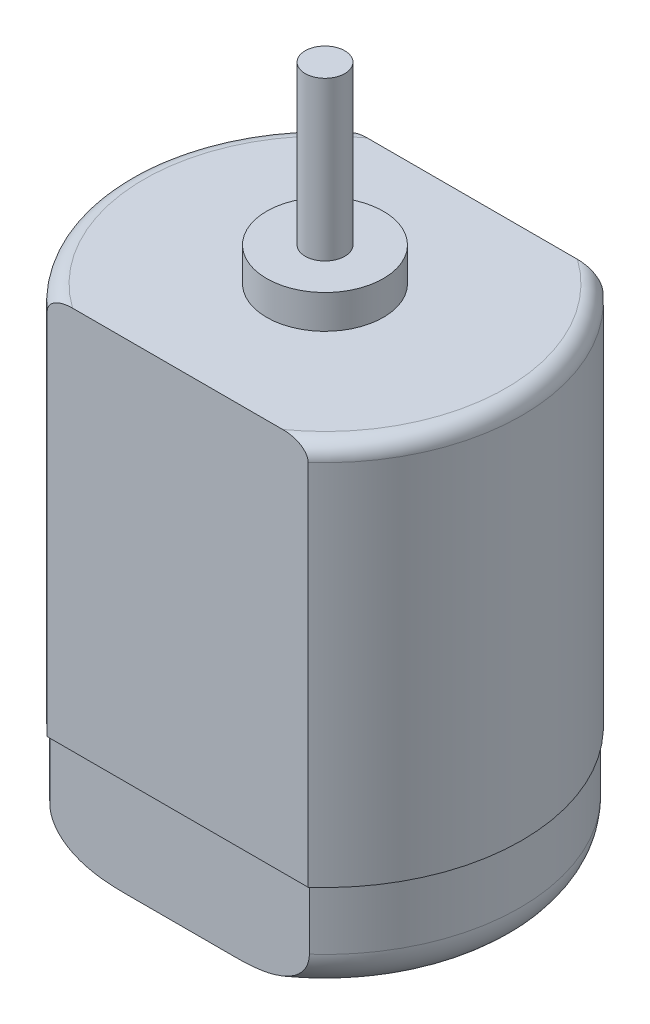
ISO-10303-21;
HEADER;
FILE_DESCRIPTION(('STEP AP214'),'2;1');
FILE_NAME('part.step','',(''),(''),'','','');
FILE_SCHEMA(('AUTOMOTIVE_DESIGN { 1 0 10303 214 1 1 1 1 }'));
ENDSEC;
DATA;
#1=APPLICATION_CONTEXT('core data for automotive mechanical design processes');
#2=APPLICATION_PROTOCOL_DEFINITION('international standard','automotive_design',2000,#1);
#3=PRODUCT_CONTEXT('',#1,'mechanical');
#4=PRODUCT('Part','Part','',(#3));
#5=PRODUCT_RELATED_PRODUCT_CATEGORY('part','',(#4));
#6=PRODUCT_DEFINITION_FORMATION('','',#4);
#7=PRODUCT_DEFINITION_CONTEXT('part definition',#1,'design');
#8=PRODUCT_DEFINITION('design','',#6,#7);
#9=PRODUCT_DEFINITION_SHAPE('','',#8);
#10=(LENGTH_UNIT() NAMED_UNIT(*) SI_UNIT(.MILLI.,.METRE.));
#11=(NAMED_UNIT(*) PLANE_ANGLE_UNIT() SI_UNIT($,.RADIAN.));
#12=(NAMED_UNIT(*) SI_UNIT($,.STERADIAN.) SOLID_ANGLE_UNIT());
#13=UNCERTAINTY_MEASURE_WITH_UNIT(LENGTH_MEASURE(1.E-05),#10,'distance_accuracy_value','');
#14=(GEOMETRIC_REPRESENTATION_CONTEXT(3) GLOBAL_UNCERTAINTY_ASSIGNED_CONTEXT((#13)) GLOBAL_UNIT_ASSIGNED_CONTEXT((#10,
#11,#12)) REPRESENTATION_CONTEXT('',''));
#15=CARTESIAN_POINT('',(0.,0.,0.));
#16=DIRECTION('',(0.,0.,1.));
#17=DIRECTION('',(1.,0.,0.));
#18=AXIS2_PLACEMENT_3D('',#15,#16,#17);
#19=CARTESIAN_POINT('',(-6.59545297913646,19.4,-7.44999999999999));
#20=DIRECTION('',(0.,0.,-1.));
#21=DIRECTION('',(-1.,0.,0.));
#22=AXIS2_PLACEMENT_3D('',#19,#20,#21);
#23=PLANE('',#22);
#24=DIRECTION('',(1.,0.,0.));
#25=VECTOR('',#24,1.);
#26=CARTESIAN_POINT('',(-6.59545297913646,19.4,-7.44999999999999));
#27=LINE('',#26,#25);
#28=CARTESIAN_POINT('',(-5.31224999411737,19.4,-7.45));
#29=VERTEX_POINT('',#28);
#30=CARTESIAN_POINT('',(5.31224999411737,19.4,-7.45));
#31=VERTEX_POINT('',#30);
#32=EDGE_CURVE('E153',#29,#31,#27,.T.);
#33=ORIENTED_EDGE('',*,*,#32,.T.);
#34=CARTESIAN_POINT('',(5.31224999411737,19.4,-7.45));
#35=CARTESIAN_POINT('',(5.37212717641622,19.3999761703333,-7.45));
#36=CARTESIAN_POINT('',(5.43204752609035,19.3977311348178,-7.45));
#37=CARTESIAN_POINT('',(5.55178025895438,19.388304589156,-7.45));
#38=CARTESIAN_POINT('',(5.61159075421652,19.3810995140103,-7.45));
#39=CARTESIAN_POINT('',(5.73121107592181,19.3611021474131,-7.45));
#40=CARTESIAN_POINT('',(5.79100763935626,19.348228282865,-7.45));
#41=CARTESIAN_POINT('',(5.90879750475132,19.3162079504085,-7.45));
#42=CARTESIAN_POINT('',(5.96679452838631,19.2970755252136,-7.45));
#43=CARTESIAN_POINT('',(6.07276043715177,19.2545576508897,-7.45));
#44=CARTESIAN_POINT('',(6.12106668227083,19.2320224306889,-7.45));
#45=CARTESIAN_POINT('',(6.21424464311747,19.1808940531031,-7.45));
#46=CARTESIAN_POINT('',(6.2591267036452,19.1523202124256,-7.45));
#47=CARTESIAN_POINT('',(6.33743386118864,19.0932702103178,-7.45));
#48=CARTESIAN_POINT('',(6.37156436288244,19.0637389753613,-7.45));
#49=CARTESIAN_POINT('',(6.43466683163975,18.999540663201,-7.45));
#50=CARTESIAN_POINT('',(6.46364463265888,18.96487947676,-7.45));
#51=CARTESIAN_POINT('',(6.50806102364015,18.8999258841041,-7.45));
#52=CARTESIAN_POINT('',(6.52507292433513,18.8707127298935,-7.45));
#53=CARTESIAN_POINT('',(6.55408312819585,18.8099248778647,-7.45));
#54=CARTESIAN_POINT('',(6.56609311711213,18.7783558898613,-7.45));
#55=CARTESIAN_POINT('',(6.58181609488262,18.7222889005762,-7.45));
#56=CARTESIAN_POINT('',(6.58689114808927,18.6981690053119,-7.45));
#57=CARTESIAN_POINT('',(6.59372754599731,18.6493763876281,-7.45));
#58=CARTESIAN_POINT('',(6.59547660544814,18.6247019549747,-7.45));
#59=CARTESIAN_POINT('',(6.59545297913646,18.6,-7.45));
#60=B_SPLINE_CURVE_WITH_KNOTS('',3,(#34,#35,#36,#37,#38,#39,#40,#41,#42,#43,#44,#45,#46,#47,#48,
#49,#50,#51,#52,#53,#54,#55,#56,#57,#58,#59),.UNSPECIFIED.,.F.,.F.,(4,2,2,2,2,2,2,2,2,2,2,2,4),
(0.,0.179656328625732,0.360172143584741,0.543375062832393,0.726169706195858,0.885719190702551,
1.04476582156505,1.17970347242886,1.31448735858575,1.41552205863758,1.5163193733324,
1.59004458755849,1.66404159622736),.UNSPECIFIED.);
#61=CARTESIAN_POINT('',(6.59545297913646,18.6,-7.45));
#62=VERTEX_POINT('',#61);
#63=EDGE_CURVE('E190',#31,#62,#60,.T.);
#64=ORIENTED_EDGE('',*,*,#63,.T.);
#65=DIRECTION('',(0.,-1.,0.));
#66=VECTOR('',#65,1.);
#67=CARTESIAN_POINT('',(6.59545297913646,19.4,-7.45));
#68=LINE('',#67,#66);
#69=CARTESIAN_POINT('',(6.59545297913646,0.,-7.45));
#70=VERTEX_POINT('',#69);
#71=EDGE_CURVE('E160',#62,#70,#68,.T.);
#72=ORIENTED_EDGE('',*,*,#71,.T.);
#73=DIRECTION('',(1.,0.,0.));
#74=VECTOR('',#73,1.);
#75=CARTESIAN_POINT('',(-6.59545297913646,0.,-7.44999999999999));
#76=LINE('',#75,#74);
#77=CARTESIAN_POINT('',(-6.59545297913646,0.,-7.45));
#78=VERTEX_POINT('',#77);
#79=EDGE_CURVE('E149',#78,#70,#76,.T.);
#80=ORIENTED_EDGE('',*,*,#79,.F.);
#81=DIRECTION('',(0.,-1.,0.));
#82=VECTOR('',#81,1.);
#83=CARTESIAN_POINT('',(-6.59545297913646,19.4,-7.45));
#84=LINE('',#83,#82);
#85=CARTESIAN_POINT('',(-6.59545297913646,18.6,-7.45));
#86=VERTEX_POINT('',#85);
#87=EDGE_CURVE('E152',#86,#78,#84,.T.);
#88=ORIENTED_EDGE('',*,*,#87,.F.);
#89=CARTESIAN_POINT('',(-6.59545297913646,18.6,-7.45));
#90=CARTESIAN_POINT('',(-6.5954565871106,18.6171653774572,-7.45));
#91=CARTESIAN_POINT('',(-6.59461876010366,18.634319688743,-7.44999999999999));
#92=CARTESIAN_POINT('',(-6.59130191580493,18.6684543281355,-7.44999999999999));
#93=CARTESIAN_POINT('',(-6.58882432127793,18.6854347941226,-7.44999999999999));
#94=CARTESIAN_POINT('',(-6.57905857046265,18.735591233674,-7.44999999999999));
#95=CARTESIAN_POINT('',(-6.56943553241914,18.7683357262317,-7.44999999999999));
#96=CARTESIAN_POINT('',(-6.54475043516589,18.8315278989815,-7.44999999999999));
#97=CARTESIAN_POINT('',(-6.52970534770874,18.8619823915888,-7.44999999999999));
#98=CARTESIAN_POINT('',(-6.49510796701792,18.9202734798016,-7.44999999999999));
#99=CARTESIAN_POINT('',(-6.47554459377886,18.9481033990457,-7.44999999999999));
#100=CARTESIAN_POINT('',(-6.42344190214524,19.0125072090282,-7.44999999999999));
#101=CARTESIAN_POINT('',(-6.38898465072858,19.0475257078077,-7.44999999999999));
#102=CARTESIAN_POINT('',(-6.31498583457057,19.1116407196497,-7.44999999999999));
#103=CARTESIAN_POINT('',(-6.27543578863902,19.1407271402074,-7.44999999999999));
#104=CARTESIAN_POINT('',(-6.17218228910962,19.2066666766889,-7.44999999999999));
#105=CARTESIAN_POINT('',(-6.10630968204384,19.2401038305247,-7.44999999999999));
#106=CARTESIAN_POINT('',(-5.97009550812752,19.2965515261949,-7.44999999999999));
#107=CARTESIAN_POINT('',(-5.89973622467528,19.3195173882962,-7.44999999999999));
#108=CARTESIAN_POINT('',(-5.78592935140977,19.3488663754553,-7.44999999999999));
#109=CARTESIAN_POINT('',(-5.74320453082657,19.3581929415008,-7.45));
#110=CARTESIAN_POINT('',(-5.65720021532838,19.3739226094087,-7.45));
#111=CARTESIAN_POINT('',(-5.61392050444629,19.3803245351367,-7.45));
#112=CARTESIAN_POINT('',(-5.52761769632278,19.3903474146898,-7.45));
#113=CARTESIAN_POINT('',(-5.48459856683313,19.3940034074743,-7.45));
#114=CARTESIAN_POINT('',(-5.398466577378,19.3988252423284,-7.45));
#115=CARTESIAN_POINT('',(-5.35535387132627,19.3999938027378,-7.45));
#116=CARTESIAN_POINT('',(-5.31224999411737,19.4,-7.45));
#117=B_SPLINE_CURVE_WITH_KNOTS('',3,(#89,#90,#91,#92,#93,#94,#95,#96,#97,#98,#99,#100,#101,#102,
#103,#104,#105,#106,#107,#108,#109,#110,#111,#112,#113,#114,#115,#116),.UNSPECIFIED.,.F.,.F.,(4,
2,2,2,2,2,2,2,2,2,2,2,2,4),(0.,0.0514548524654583,0.102865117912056,0.204642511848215,
0.306104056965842,0.407817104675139,0.55437976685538,0.701189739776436,0.921595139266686,
1.14293237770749,1.27403335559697,1.40518700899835,1.53463725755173,1.66394596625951),.UNSPECIFIED.);
#118=EDGE_CURVE('E182',#86,#29,#117,.T.);
#119=ORIENTED_EDGE('',*,*,#118,.T.);
#120=EDGE_LOOP('',(#33,#64,#72,#80,#88,#119));
#121=FACE_BOUND('',#120,.T.);
#122=ADVANCED_FACE('F16',(#121),#23,.T.);
#123=CARTESIAN_POINT('',(0.,19.4,0.));
#124=DIRECTION('',(0.,-1.,0.));
#125=DIRECTION('',(0.,0.,-1.));
#126=AXIS2_PLACEMENT_3D('',#123,#124,#125);
#127=CYLINDRICAL_SURFACE('',#126,9.95);
#128=DIRECTION('',(0.,-1.,0.));
#129=VECTOR('',#128,1.);
#130=CARTESIAN_POINT('',(-6.59545297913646,19.4,7.44999999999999));
#131=LINE('',#130,#129);
#132=CARTESIAN_POINT('',(-6.59545297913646,18.6,7.44999999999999));
#133=VERTEX_POINT('',#132);
#134=CARTESIAN_POINT('',(-6.59545297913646,0.,7.44999999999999));
#135=VERTEX_POINT('',#134);
#136=EDGE_CURVE('E172',#133,#135,#131,.T.);
#137=ORIENTED_EDGE('',*,*,#136,.F.);
#138=CARTESIAN_POINT('',(0.,18.6,0.));
#139=DIRECTION('',(0.,1.,0.));
#140=DIRECTION('',(0.,0.,1.));
#141=AXIS2_PLACEMENT_3D('',#138,#139,#140);
#142=CIRCLE('',#141,9.95);
#143=EDGE_CURVE('E257',#133,#86,#142,.F.);
#144=ORIENTED_EDGE('',*,*,#143,.T.);
#145=ORIENTED_EDGE('',*,*,#87,.T.);
#146=CARTESIAN_POINT('',(0.,0.,0.));
#147=DIRECTION('',(0.,1.,0.));
#148=DIRECTION('',(0.,0.,1.));
#149=AXIS2_PLACEMENT_3D('',#146,#147,#148);
#150=CIRCLE('',#149,9.95);
#151=EDGE_CURVE('E157',#78,#135,#150,.T.);
#152=ORIENTED_EDGE('',*,*,#151,.T.);
#153=EDGE_LOOP('',(#137,#144,#145,#152));
#154=FACE_BOUND('',#153,.T.);
#155=ADVANCED_FACE('F229',(#154),#127,.T.);
#156=CARTESIAN_POINT('',(6.59545297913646,19.4,7.45));
#157=DIRECTION('',(0.,0.,1.));
#158=DIRECTION('',(1.,0.,0.));
#159=AXIS2_PLACEMENT_3D('',#156,#157,#158);
#160=PLANE('',#159);
#161=DIRECTION('',(0.,-1.,0.));
#162=VECTOR('',#161,1.);
#163=CARTESIAN_POINT('',(6.59545297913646,19.4,7.45));
#164=LINE('',#163,#162);
#165=CARTESIAN_POINT('',(6.59545297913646,18.6,7.45));
#166=VERTEX_POINT('',#165);
#167=CARTESIAN_POINT('',(6.59545297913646,0.,7.45));
#168=VERTEX_POINT('',#167);
#169=EDGE_CURVE('E174',#166,#168,#164,.T.);
#170=ORIENTED_EDGE('',*,*,#169,.F.);
#171=CARTESIAN_POINT('',(6.59545297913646,18.6,7.45));
#172=CARTESIAN_POINT('',(6.5954565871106,18.6171653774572,7.45));
#173=CARTESIAN_POINT('',(6.59461876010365,18.634319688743,7.45));
#174=CARTESIAN_POINT('',(6.59130191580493,18.6684543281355,7.45));
#175=CARTESIAN_POINT('',(6.58882432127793,18.6854347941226,7.45));
#176=CARTESIAN_POINT('',(6.57905857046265,18.735591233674,7.45));
#177=CARTESIAN_POINT('',(6.56943553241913,18.7683357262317,7.45));
#178=CARTESIAN_POINT('',(6.54475043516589,18.8315278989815,7.45));
#179=CARTESIAN_POINT('',(6.52970534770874,18.8619823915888,7.45));
#180=CARTESIAN_POINT('',(6.49510796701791,18.9202734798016,7.45));
#181=CARTESIAN_POINT('',(6.47554459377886,18.9481033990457,7.45));
#182=CARTESIAN_POINT('',(6.42344190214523,19.0125072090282,7.45));
#183=CARTESIAN_POINT('',(6.38898465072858,19.0475257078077,7.45));
#184=CARTESIAN_POINT('',(6.31498583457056,19.1116407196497,7.45));
#185=CARTESIAN_POINT('',(6.27543578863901,19.1407271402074,7.45));
#186=CARTESIAN_POINT('',(6.17218228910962,19.2066666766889,7.45));
#187=CARTESIAN_POINT('',(6.10630968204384,19.2401038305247,7.45));
#188=CARTESIAN_POINT('',(5.97009550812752,19.2965515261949,7.45));
#189=CARTESIAN_POINT('',(5.89973622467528,19.3195173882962,7.45));
#190=CARTESIAN_POINT('',(5.78592935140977,19.3488663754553,7.45));
#191=CARTESIAN_POINT('',(5.74320453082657,19.3581929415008,7.45));
#192=CARTESIAN_POINT('',(5.65720021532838,19.3739226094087,7.45));
#193=CARTESIAN_POINT('',(5.61392050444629,19.3803245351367,7.45));
#194=CARTESIAN_POINT('',(5.52761769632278,19.3903474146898,7.45));
#195=CARTESIAN_POINT('',(5.48459856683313,19.3940034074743,7.45));
#196=CARTESIAN_POINT('',(5.39846657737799,19.3988252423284,7.45));
#197=CARTESIAN_POINT('',(5.35535387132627,19.3999938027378,7.45));
#198=CARTESIAN_POINT('',(5.31224999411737,19.4,7.45));
#199=B_SPLINE_CURVE_WITH_KNOTS('',3,(#171,#172,#173,#174,#175,#176,#177,#178,#179,#180,#181,
#182,#183,#184,#185,#186,#187,#188,#189,#190,#191,#192,#193,#194,#195,#196,#197,#198),
.UNSPECIFIED.,.F.,.F.,(4,2,2,2,2,2,2,2,2,2,2,2,2,4),(0.,0.0514548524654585,0.102865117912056,
0.204642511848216,0.306104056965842,0.40781710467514,0.554379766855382,0.701189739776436,
0.921595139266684,1.14293237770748,1.27403335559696,1.40518700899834,1.53463725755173,
1.66394596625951),.UNSPECIFIED.);
#200=CARTESIAN_POINT('',(5.31224999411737,19.4,7.45));
#201=VERTEX_POINT('',#200);
#202=EDGE_CURVE('E217',#166,#201,#199,.T.);
#203=ORIENTED_EDGE('',*,*,#202,.T.);
#204=DIRECTION('',(-1.,0.,0.));
#205=VECTOR('',#204,1.);
#206=CARTESIAN_POINT('',(6.59545297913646,19.4,7.45));
#207=LINE('',#206,#205);
#208=CARTESIAN_POINT('',(-5.31224999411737,19.4,7.45));
#209=VERTEX_POINT('',#208);
#210=EDGE_CURVE('E156',#201,#209,#207,.T.);
#211=ORIENTED_EDGE('',*,*,#210,.T.);
#212=CARTESIAN_POINT('',(-5.31224999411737,19.4,7.45));
#213=CARTESIAN_POINT('',(-5.37212717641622,19.3999761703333,7.45));
#214=CARTESIAN_POINT('',(-5.43204752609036,19.3977311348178,7.45));
#215=CARTESIAN_POINT('',(-5.55178025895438,19.388304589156,7.45));
#216=CARTESIAN_POINT('',(-5.61159075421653,19.3810995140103,7.45));
#217=CARTESIAN_POINT('',(-5.73121107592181,19.3611021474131,7.45));
#218=CARTESIAN_POINT('',(-5.79100763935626,19.348228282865,7.45));
#219=CARTESIAN_POINT('',(-5.90879750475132,19.3162079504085,7.45));
#220=CARTESIAN_POINT('',(-5.96679452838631,19.2970755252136,7.45));
#221=CARTESIAN_POINT('',(-6.07276043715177,19.2545576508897,7.45));
#222=CARTESIAN_POINT('',(-6.12106668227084,19.2320224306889,7.45));
#223=CARTESIAN_POINT('',(-6.21424464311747,19.1808940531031,7.45));
#224=CARTESIAN_POINT('',(-6.2591267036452,19.1523202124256,7.45));
#225=CARTESIAN_POINT('',(-6.33743386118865,19.0932702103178,7.45));
#226=CARTESIAN_POINT('',(-6.37156436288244,19.0637389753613,7.45));
#227=CARTESIAN_POINT('',(-6.43466683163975,18.999540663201,7.45));
#228=CARTESIAN_POINT('',(-6.46364463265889,18.96487947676,7.45));
#229=CARTESIAN_POINT('',(-6.50806102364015,18.8999258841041,7.45));
#230=CARTESIAN_POINT('',(-6.52507292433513,18.8707127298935,7.45));
#231=CARTESIAN_POINT('',(-6.55408312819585,18.8099248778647,7.45));
#232=CARTESIAN_POINT('',(-6.56609311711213,18.7783558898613,7.45));
#233=CARTESIAN_POINT('',(-6.58181609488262,18.7222889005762,7.45));
#234=CARTESIAN_POINT('',(-6.58689114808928,18.6981690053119,7.45));
#235=CARTESIAN_POINT('',(-6.59372754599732,18.6493763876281,7.45));
#236=CARTESIAN_POINT('',(-6.59547660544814,18.6247019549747,7.45));
#237=CARTESIAN_POINT('',(-6.59545297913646,18.6,7.45));
#238=B_SPLINE_CURVE_WITH_KNOTS('',3,(#212,#213,#214,#215,#216,#217,#218,#219,#220,#221,#222,
#223,#224,#225,#226,#227,#228,#229,#230,#231,#232,#233,#234,#235,#236,#237),.UNSPECIFIED.,.F.,
.F.,(4,2,2,2,2,2,2,2,2,2,2,2,4),(0.,0.179656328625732,0.360172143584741,0.543375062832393,
0.726169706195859,0.885719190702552,1.04476582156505,1.17970347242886,1.31448735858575,
1.41552205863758,1.5163193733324,1.59004458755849,1.66404159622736),.UNSPECIFIED.);
#239=EDGE_CURVE('E210',#209,#133,#238,.T.);
#240=ORIENTED_EDGE('',*,*,#239,.T.);
#241=ORIENTED_EDGE('',*,*,#136,.T.);
#242=DIRECTION('',(-1.,0.,0.));
#243=VECTOR('',#242,1.);
#244=CARTESIAN_POINT('',(6.59545297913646,0.,7.45));
#245=LINE('',#244,#243);
#246=EDGE_CURVE('E166',#168,#135,#245,.T.);
#247=ORIENTED_EDGE('',*,*,#246,.F.);
#248=EDGE_LOOP('',(#170,#203,#211,#240,#241,#247));
#249=FACE_BOUND('',#248,.T.);
#250=ADVANCED_FACE('F224',(#249),#160,.T.);
#251=CARTESIAN_POINT('',(0.,19.4,0.));
#252=DIRECTION('',(0.,-1.,0.));
#253=DIRECTION('',(0.,0.,-1.));
#254=AXIS2_PLACEMENT_3D('',#251,#252,#253);
#255=CYLINDRICAL_SURFACE('',#254,9.95);
#256=ORIENTED_EDGE('',*,*,#71,.F.);
#257=CARTESIAN_POINT('',(0.,18.6,0.));
#258=DIRECTION('',(0.,1.,0.));
#259=DIRECTION('',(0.,0.,1.));
#260=AXIS2_PLACEMENT_3D('',#257,#258,#259);
#261=CIRCLE('',#260,9.95);
#262=EDGE_CURVE('E218',#62,#166,#261,.F.);
#263=ORIENTED_EDGE('',*,*,#262,.T.);
#264=ORIENTED_EDGE('',*,*,#169,.T.);
#265=CARTESIAN_POINT('',(0.,0.,0.));
#266=DIRECTION('',(0.,1.,0.));
#267=DIRECTION('',(0.,0.,1.));
#268=AXIS2_PLACEMENT_3D('',#265,#266,#267);
#269=CIRCLE('',#268,9.95);
#270=EDGE_CURVE('E163',#168,#70,#269,.T.);
#271=ORIENTED_EDGE('',*,*,#270,.T.);
#272=EDGE_LOOP('',(#256,#263,#264,#271));
#273=FACE_BOUND('',#272,.T.);
#274=ADVANCED_FACE('F228',(#273),#255,.T.);
#275=CARTESIAN_POINT('',(0.,19.4,0.));
#276=DIRECTION('',(0.,1.,0.));
#277=DIRECTION('',(0.,0.,1.));
#278=AXIS2_PLACEMENT_3D('',#275,#276,#277);
#279=PLANE('',#278);
#280=CARTESIAN_POINT('',(0.,19.4,0.));
#281=DIRECTION('',(0.,1.,0.));
#282=DIRECTION('',(0.,0.,1.));
#283=AXIS2_PLACEMENT_3D('',#280,#281,#282);
#284=CIRCLE('',#283,2.95);
#285=CARTESIAN_POINT('',(0.,19.4,2.95));
#286=VERTEX_POINT('',#285);
#287=EDGE_CURVE('E146',#286,#286,#284,.T.);
#288=ORIENTED_EDGE('',*,*,#287,.F.);
#289=EDGE_LOOP('',(#288));
#290=FACE_BOUND('',#289,.T.);
#291=ORIENTED_EDGE('',*,*,#210,.F.);
#292=CARTESIAN_POINT('',(0.,19.4,0.));
#293=DIRECTION('',(0.,1.,0.));
#294=DIRECTION('',(0.,0.,1.));
#295=AXIS2_PLACEMENT_3D('',#292,#293,#294);
#296=CIRCLE('',#295,9.15);
#297=EDGE_CURVE('E179',#201,#31,#296,.T.);
#298=ORIENTED_EDGE('',*,*,#297,.T.);
#299=ORIENTED_EDGE('',*,*,#32,.F.);
#300=CARTESIAN_POINT('',(0.,19.4,0.));
#301=DIRECTION('',(0.,1.,0.));
#302=DIRECTION('',(0.,0.,1.));
#303=AXIS2_PLACEMENT_3D('',#300,#301,#302);
#304=CIRCLE('',#303,9.15);
#305=EDGE_CURVE('E145',#29,#209,#304,.T.);
#306=ORIENTED_EDGE('',*,*,#305,.T.);
#307=EDGE_LOOP('',(#291,#298,#299,#306));
#308=FACE_BOUND('',#307,.T.);
#309=ADVANCED_FACE('F234',(#290,#308),#279,.T.);
#310=CARTESIAN_POINT('',(0.,0.,0.));
#311=DIRECTION('',(0.,1.,0.));
#312=DIRECTION('',(0.,0.,1.));
#313=AXIS2_PLACEMENT_3D('',#310,#311,#312);
#314=PLANE('',#313);
#315=DIRECTION('',(-1.,0.,0.));
#316=VECTOR('',#315,1.);
#317=CARTESIAN_POINT('',(6.557438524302,0.,7.35));
#318=LINE('',#317,#316);
#319=CARTESIAN_POINT('',(6.557438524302,0.,7.35));
#320=VERTEX_POINT('',#319);
#321=CARTESIAN_POINT('',(-6.557438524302,0.,7.35));
#322=VERTEX_POINT('',#321);
#323=EDGE_CURVE('E120',#320,#322,#318,.T.);
#324=ORIENTED_EDGE('',*,*,#323,.F.);
#325=CARTESIAN_POINT('',(0.,0.,0.));
#326=DIRECTION('',(0.,1.,0.));
#327=DIRECTION('',(0.,0.,1.));
#328=AXIS2_PLACEMENT_3D('',#325,#326,#327);
#329=CIRCLE('',#328,9.85);
#330=CARTESIAN_POINT('',(6.557438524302,0.,-7.34999999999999));
#331=VERTEX_POINT('',#330);
#332=EDGE_CURVE('E519',#320,#331,#329,.T.);
#333=ORIENTED_EDGE('',*,*,#332,.T.);
#334=DIRECTION('',(1.,0.,0.));
#335=VECTOR('',#334,1.);
#336=CARTESIAN_POINT('',(-6.557438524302,0.,-7.34999999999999));
#337=LINE('',#336,#335);
#338=CARTESIAN_POINT('',(-6.557438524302,0.,-7.35));
#339=VERTEX_POINT('',#338);
#340=EDGE_CURVE('E123',#339,#331,#337,.T.);
#341=ORIENTED_EDGE('',*,*,#340,.F.);
#342=CARTESIAN_POINT('',(0.,0.,0.));
#343=DIRECTION('',(0.,1.,0.));
#344=DIRECTION('',(0.,0.,1.));
#345=AXIS2_PLACEMENT_3D('',#342,#343,#344);
#346=CIRCLE('',#345,9.85);
#347=EDGE_CURVE('E109',#339,#322,#346,.T.);
#348=ORIENTED_EDGE('',*,*,#347,.T.);
#349=EDGE_LOOP('',(#324,#333,#341,#348));
#350=FACE_BOUND('',#349,.T.);
#351=ORIENTED_EDGE('',*,*,#79,.T.);
#352=ORIENTED_EDGE('',*,*,#270,.F.);
#353=ORIENTED_EDGE('',*,*,#246,.T.);
#354=ORIENTED_EDGE('',*,*,#151,.F.);
#355=EDGE_LOOP('',(#351,#352,#353,#354));
#356=FACE_BOUND('',#355,.T.);
#357=ADVANCED_FACE('F117',(#350,#356),#314,.F.);
#358=CARTESIAN_POINT('',(0.,21.1,0.));
#359=DIRECTION('',(0.,-1.,0.));
#360=DIRECTION('',(0.,0.,-1.));
#361=AXIS2_PLACEMENT_3D('',#358,#359,#360);
#362=CYLINDRICAL_SURFACE('',#361,2.95);
#363=CARTESIAN_POINT('',(0.,21.1,0.));
#364=DIRECTION('',(0.,1.,0.));
#365=DIRECTION('',(0.,0.,1.));
#366=AXIS2_PLACEMENT_3D('',#363,#364,#365);
#367=CIRCLE('',#366,2.95);
#368=CARTESIAN_POINT('',(0.,21.1,2.95));
#369=VERTEX_POINT('',#368);
#370=EDGE_CURVE('E141',#369,#369,#367,.T.);
#371=ORIENTED_EDGE('',*,*,#370,.F.);
#372=EDGE_LOOP('',(#371));
#373=FACE_BOUND('',#372,.T.);
#374=ORIENTED_EDGE('',*,*,#287,.T.);
#375=EDGE_LOOP('',(#374));
#376=FACE_BOUND('',#375,.T.);
#377=ADVANCED_FACE('F307',(#373,#376),#362,.T.);
#378=CARTESIAN_POINT('',(0.,21.1,0.));
#379=DIRECTION('',(0.,1.,0.));
#380=DIRECTION('',(0.,0.,1.));
#381=AXIS2_PLACEMENT_3D('',#378,#379,#380);
#382=PLANE('',#381);
#383=CARTESIAN_POINT('',(0.,21.1,0.));
#384=DIRECTION('',(0.,1.,0.));
#385=DIRECTION('',(0.,0.,1.));
#386=AXIS2_PLACEMENT_3D('',#383,#384,#385);
#387=CIRCLE('',#386,1.);
#388=CARTESIAN_POINT('',(0.,21.1,1.));
#389=VERTEX_POINT('',#388);
#390=EDGE_CURVE('E142',#389,#389,#387,.T.);
#391=ORIENTED_EDGE('',*,*,#390,.F.);
#392=EDGE_LOOP('',(#391));
#393=FACE_BOUND('',#392,.T.);
#394=ORIENTED_EDGE('',*,*,#370,.T.);
#395=EDGE_LOOP('',(#394));
#396=FACE_BOUND('',#395,.T.);
#397=ADVANCED_FACE('F303',(#393,#396),#382,.T.);
#398=CARTESIAN_POINT('',(0.,29.1,0.));
#399=DIRECTION('',(0.,-1.,0.));
#400=DIRECTION('',(0.,0.,-1.));
#401=AXIS2_PLACEMENT_3D('',#398,#399,#400);
#402=CYLINDRICAL_SURFACE('',#401,1.);
#403=CARTESIAN_POINT('',(0.,29.1,0.));
#404=DIRECTION('',(0.,1.,0.));
#405=DIRECTION('',(0.,0.,1.));
#406=AXIS2_PLACEMENT_3D('',#403,#404,#405);
#407=CIRCLE('',#406,1.);
#408=CARTESIAN_POINT('',(0.,29.1,1.));
#409=VERTEX_POINT('',#408);
#410=EDGE_CURVE('E134',#409,#409,#407,.T.);
#411=ORIENTED_EDGE('',*,*,#410,.F.);
#412=EDGE_LOOP('',(#411));
#413=FACE_BOUND('',#412,.T.);
#414=ORIENTED_EDGE('',*,*,#390,.T.);
#415=EDGE_LOOP('',(#414));
#416=FACE_BOUND('',#415,.T.);
#417=ADVANCED_FACE('F299',(#413,#416),#402,.T.);
#418=CARTESIAN_POINT('',(0.,29.1,0.));
#419=DIRECTION('',(0.,1.,0.));
#420=DIRECTION('',(0.,0.,1.));
#421=AXIS2_PLACEMENT_3D('',#418,#419,#420);
#422=PLANE('',#421);
#423=ORIENTED_EDGE('',*,*,#410,.T.);
#424=EDGE_LOOP('',(#423));
#425=FACE_BOUND('',#424,.T.);
#426=ADVANCED_FACE('F296',(#425),#422,.T.);
#427=CARTESIAN_POINT('',(0.,18.6,0.));
#428=DIRECTION('',(0.,1.,0.));
#429=DIRECTION('',(0.,0.,1.));
#430=AXIS2_PLACEMENT_3D('',#427,#428,#429);
#431=TOROIDAL_SURFACE('',#430,9.15,0.8);
#432=ORIENTED_EDGE('',*,*,#202,.F.);
#433=ORIENTED_EDGE('',*,*,#262,.F.);
#434=ORIENTED_EDGE('',*,*,#63,.F.);
#435=ORIENTED_EDGE('',*,*,#297,.F.);
#436=EDGE_LOOP('',(#432,#433,#434,#435));
#437=FACE_BOUND('',#436,.T.);
#438=ADVANCED_FACE('F203',(#437),#431,.T.);
#439=CARTESIAN_POINT('',(0.,18.6,0.));
#440=DIRECTION('',(0.,1.,0.));
#441=DIRECTION('',(0.,0.,1.));
#442=AXIS2_PLACEMENT_3D('',#439,#440,#441);
#443=TOROIDAL_SURFACE('',#442,9.15,0.8);
#444=ORIENTED_EDGE('',*,*,#118,.F.);
#445=ORIENTED_EDGE('',*,*,#143,.F.);
#446=ORIENTED_EDGE('',*,*,#239,.F.);
#447=ORIENTED_EDGE('',*,*,#305,.F.);
#448=EDGE_LOOP('',(#444,#445,#446,#447));
#449=FACE_BOUND('',#448,.T.);
#450=ADVANCED_FACE('F199',(#449),#443,.T.);
#451=CARTESIAN_POINT('',(0.,-5.,0.));
#452=DIRECTION('',(0.,1.,0.));
#453=DIRECTION('',(0.,0.,1.));
#454=AXIS2_PLACEMENT_3D('',#451,#452,#453);
#455=CYLINDRICAL_SURFACE('',#454,9.85);
#456=DIRECTION('',(0.,1.,0.));
#457=VECTOR('',#456,1.);
#458=CARTESIAN_POINT('',(6.557438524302,-5.,7.35));
#459=LINE('',#458,#457);
#460=CARTESIAN_POINT('',(6.557438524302,-3.,7.35));
#461=VERTEX_POINT('',#460);
#462=EDGE_CURVE('E111',#461,#320,#459,.T.);
#463=ORIENTED_EDGE('',*,*,#462,.F.);
#464=CARTESIAN_POINT('',(0.,-3.,0.));
#465=DIRECTION('',(0.,1.,0.));
#466=DIRECTION('',(0.,0.,1.));
#467=AXIS2_PLACEMENT_3D('',#464,#465,#466);
#468=CIRCLE('',#467,9.85);
#469=CARTESIAN_POINT('',(6.557438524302,-3.,-7.34999999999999));
#470=VERTEX_POINT('',#469);
#471=EDGE_CURVE('E267',#461,#470,#468,.T.);
#472=ORIENTED_EDGE('',*,*,#471,.T.);
#473=DIRECTION('',(0.,1.,0.));
#474=VECTOR('',#473,1.);
#475=CARTESIAN_POINT('',(6.557438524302,-5.,-7.34999999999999));
#476=LINE('',#475,#474);
#477=EDGE_CURVE('E137',#470,#331,#476,.T.);
#478=ORIENTED_EDGE('',*,*,#477,.T.);
#479=ORIENTED_EDGE('',*,*,#332,.F.);
#480=EDGE_LOOP('',(#463,#472,#478,#479));
#481=FACE_BOUND('',#480,.T.);
#482=ADVANCED_FACE('F202',(#481),#455,.T.);
#483=CARTESIAN_POINT('',(6.557438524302,-5.,7.35));
#484=DIRECTION('',(0.,0.,-1.));
#485=DIRECTION('',(-1.,0.,0.));
#486=AXIS2_PLACEMENT_3D('',#483,#484,#485);
#487=PLANE('',#486);
#488=DIRECTION('',(-1.,0.,0.));
#489=VECTOR('',#488,1.);
#490=CARTESIAN_POINT('',(6.557438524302,-5.,7.35));
#491=LINE('',#490,#489);
#492=CARTESIAN_POINT('',(2.75680975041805,-5.,7.35));
#493=VERTEX_POINT('',#492);
#494=CARTESIAN_POINT('',(-2.75680975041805,-5.,7.35));
#495=VERTEX_POINT('',#494);
#496=EDGE_CURVE('E130',#493,#495,#491,.T.);
#497=ORIENTED_EDGE('',*,*,#496,.F.);
#498=CARTESIAN_POINT('',(2.75680975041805,-5.,7.35));
#499=CARTESIAN_POINT('',(2.84441352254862,-4.99999699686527,7.35));
#500=CARTESIAN_POINT('',(2.93201758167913,-4.9992904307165,7.35));
#501=CARTESIAN_POINT('',(3.10722214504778,-4.99608869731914,7.35));
#502=CARTESIAN_POINT('',(3.19482263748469,-4.99359290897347,7.35));
#503=CARTESIAN_POINT('',(3.45860826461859,-4.98280518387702,7.35));
#504=CARTESIAN_POINT('',(3.63468881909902,-4.97120328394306,7.35));
#505=CARTESIAN_POINT('',(3.98854590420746,-4.93545180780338,7.35));
#506=CARTESIAN_POINT('',(4.16630304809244,-4.91110004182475,7.35));
#507=CARTESIAN_POINT('',(4.51841471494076,-4.84558728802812,7.35));
#508=CARTESIAN_POINT('',(4.69277756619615,-4.80447493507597,7.35));
#509=CARTESIAN_POINT('',(4.92302188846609,-4.73460685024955,7.35));
#510=CARTESIAN_POINT('',(4.98182052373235,-4.71535122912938,7.35));
#511=CARTESIAN_POINT('',(5.09842845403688,-4.67402277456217,7.35));
#512=CARTESIAN_POINT('',(5.15623758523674,-4.65194947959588,7.35));
#513=CARTESIAN_POINT('',(5.32759087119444,-4.58125269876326,7.35));
#514=CARTESIAN_POINT('',(5.43932557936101,-4.52807464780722,7.35));
#515=CARTESIAN_POINT('',(5.65617747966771,-4.407194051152,7.35));
#516=CARTESIAN_POINT('',(5.76122047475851,-4.33935639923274,7.35));
#517=CARTESIAN_POINT('',(5.959316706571,-4.18780375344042,7.35));
#518=CARTESIAN_POINT('',(6.0523856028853,-4.10410985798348,7.35));
#519=CARTESIAN_POINT('',(6.19698505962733,-3.9461901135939,7.35));
#520=CARTESIAN_POINT('',(6.25283385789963,-3.8759304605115,7.35));
#521=CARTESIAN_POINT('',(6.3526646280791,-3.72736125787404,7.35));
#522=CARTESIAN_POINT('',(6.39665601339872,-3.64905816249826,7.35));
#523=CARTESIAN_POINT('',(6.46529068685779,-3.49629905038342,7.35));
#524=CARTESIAN_POINT('',(6.49168969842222,-3.42263336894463,7.35));
#525=CARTESIAN_POINT('',(6.53172557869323,-3.27196654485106,7.35));
#526=CARTESIAN_POINT('',(6.54539016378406,-3.19497302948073,7.35));
#527=CARTESIAN_POINT('',(6.55397908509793,-3.09794771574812,7.35));
#528=CARTESIAN_POINT('',(6.55527619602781,-3.07837101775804,7.35));
#529=CARTESIAN_POINT('',(6.55700476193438,-3.03919860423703,7.35));
#530=CARTESIAN_POINT('',(6.55743706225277,-3.01960292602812,7.35));
#531=CARTESIAN_POINT('',(6.55743852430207,-3.00000000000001,7.35));
#532=B_SPLINE_CURVE_WITH_KNOTS('',3,(#498,#499,#500,#501,#502,#503,#504,#505,#506,#507,#508,
#509,#510,#511,#512,#513,#514,#515,#516,#517,#518,#519,#520,#521,#522,#523,#524,#525,#526,#527,
#528,#529,#530,#531),.UNSPECIFIED.,.F.,.F.,(4,2,2,2,2,2,2,2,2,2,2,2,2,2,2,2,4),(0.,
0.26280505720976,0.525701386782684,1.05475756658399,1.59246975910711,2.1286326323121,
2.31418473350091,2.49976726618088,2.87010859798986,3.24402089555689,3.61743911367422,
3.88574646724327,4.15384018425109,4.38762049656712,4.62089079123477,4.67973789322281,
4.73852744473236),.UNSPECIFIED.);
#533=EDGE_CURVE('E25',#493,#461,#532,.T.);
#534=ORIENTED_EDGE('',*,*,#533,.T.);
#535=ORIENTED_EDGE('',*,*,#462,.T.);
#536=ORIENTED_EDGE('',*,*,#323,.T.);
#537=DIRECTION('',(0.,1.,0.));
#538=VECTOR('',#537,1.);
#539=CARTESIAN_POINT('',(-6.557438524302,-5.,7.35));
#540=LINE('',#539,#538);
#541=CARTESIAN_POINT('',(-6.557438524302,-3.,7.35));
#542=VERTEX_POINT('',#541);
#543=EDGE_CURVE('E105',#542,#322,#540,.T.);
#544=ORIENTED_EDGE('',*,*,#543,.F.);
#545=CARTESIAN_POINT('',(-6.557438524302,-3.,7.35));
#546=CARTESIAN_POINT('',(-6.55745272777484,-3.04241348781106,7.35));
#547=CARTESIAN_POINT('',(-6.55541239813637,-3.08481935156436,7.35));
#548=CARTESIAN_POINT('',(-6.54733193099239,-3.16921817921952,7.35));
#549=CARTESIAN_POINT('',(-6.54129471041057,-3.21121142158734,7.35));
#550=CARTESIAN_POINT('',(-6.52539556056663,-3.29410546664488,7.35));
#551=CARTESIAN_POINT('',(-6.51556573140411,-3.33501243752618,7.35));
#552=CARTESIAN_POINT('',(-6.49227989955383,-3.41577261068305,7.35));
#553=CARTESIAN_POINT('',(-6.4788234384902,-3.45562567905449,7.35));
#554=CARTESIAN_POINT('',(-6.43343825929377,-3.57296933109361,7.35));
#555=CARTESIAN_POINT('',(-6.39643314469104,-3.6485478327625,7.35));
#556=CARTESIAN_POINT('',(-6.31108723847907,-3.79306059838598,7.35));
#557=CARTESIAN_POINT('',(-6.26272144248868,-3.86197972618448,7.35));
#558=CARTESIAN_POINT('',(-6.13614165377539,-4.01809151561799,7.35));
#559=CARTESIAN_POINT('',(-6.05366566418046,-4.10182868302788,7.35));
#560=CARTESIAN_POINT('',(-5.87651046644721,-4.25495637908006,7.35));
#561=CARTESIAN_POINT('',(-5.78181815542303,-4.32433129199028,7.35));
#562=CARTESIAN_POINT('',(-5.53300076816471,-4.48241962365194,7.35));
#563=CARTESIAN_POINT('',(-5.37347260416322,-4.5625696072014,7.35));
#564=CARTESIAN_POINT('',(-5.04348385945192,-4.69821389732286,7.35));
#565=CARTESIAN_POINT('',(-4.87295372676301,-4.7535291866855,7.35));
#566=CARTESIAN_POINT('',(-4.53974218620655,-4.84075264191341,7.35));
#567=CARTESIAN_POINT('',(-4.37742255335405,-4.87409764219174,7.35));
#568=CARTESIAN_POINT('',(-4.05038094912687,-4.92736105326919,7.35));
#569=CARTESIAN_POINT('',(-3.88565502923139,-4.94725406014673,7.35));
#570=CARTESIAN_POINT('',(-3.55997925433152,-4.97633875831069,7.35));
#571=CARTESIAN_POINT('',(-3.39905310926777,-4.98581500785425,7.35));
#572=CARTESIAN_POINT('',(-3.15784442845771,-4.99468165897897,7.35));
#573=CARTESIAN_POINT('',(-3.07764148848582,-4.99674716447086,7.35));
#574=CARTESIAN_POINT('',(-2.91722863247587,-4.99940514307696,7.35));
#575=CARTESIAN_POINT('',(-2.83701872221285,-4.99999795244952,7.35));
#576=CARTESIAN_POINT('',(-2.75680975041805,-5.,7.35));
#577=B_SPLINE_CURVE_WITH_KNOTS('',3,(#545,#546,#547,#548,#549,#550,#551,#552,#553,#554,#555,
#556,#557,#558,#559,#560,#561,#562,#563,#564,#565,#566,#567,#568,#569,#570,#571,#572,#573,#574,
#575,#576),.UNSPECIFIED.,.F.,.F.,(4,2,2,2,2,2,2,2,2,2,2,2,2,2,2,4),(0.,0.127178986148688,
0.254265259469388,0.380298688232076,0.506348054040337,0.757531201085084,1.00927245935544,
1.35989543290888,1.71089765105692,2.24349049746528,2.77986313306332,3.27627539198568,
3.77362252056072,4.25701707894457,4.49769587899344,4.73831972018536),.UNSPECIFIED.);
#578=EDGE_CURVE('E32',#542,#495,#577,.T.);
#579=ORIENTED_EDGE('',*,*,#578,.T.);
#580=EDGE_LOOP('',(#497,#534,#535,#536,#544,#579));
#581=FACE_BOUND('',#580,.T.);
#582=ADVANCED_FACE('F125',(#581),#487,.F.);
#583=CARTESIAN_POINT('',(0.,-5.,0.));
#584=DIRECTION('',(0.,1.,0.));
#585=DIRECTION('',(0.,0.,1.));
#586=AXIS2_PLACEMENT_3D('',#583,#584,#585);
#587=CYLINDRICAL_SURFACE('',#586,9.85);
#588=DIRECTION('',(0.,1.,0.));
#589=VECTOR('',#588,1.);
#590=CARTESIAN_POINT('',(-6.557438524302,-5.,-7.35));
#591=LINE('',#590,#589);
#592=CARTESIAN_POINT('',(-6.557438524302,-3.,-7.35));
#593=VERTEX_POINT('',#592);
#594=EDGE_CURVE('E112',#593,#339,#591,.T.);
#595=ORIENTED_EDGE('',*,*,#594,.F.);
#596=CARTESIAN_POINT('',(0.,-3.,0.));
#597=DIRECTION('',(0.,1.,0.));
#598=DIRECTION('',(0.,0.,1.));
#599=AXIS2_PLACEMENT_3D('',#596,#597,#598);
#600=CIRCLE('',#599,9.85);
#601=EDGE_CURVE('E10',#593,#542,#600,.T.);
#602=ORIENTED_EDGE('',*,*,#601,.T.);
#603=ORIENTED_EDGE('',*,*,#543,.T.);
#604=ORIENTED_EDGE('',*,*,#347,.F.);
#605=EDGE_LOOP('',(#595,#602,#603,#604));
#606=FACE_BOUND('',#605,.T.);
#607=ADVANCED_FACE('F108',(#606),#587,.T.);
#608=CARTESIAN_POINT('',(-6.557438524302,-5.,-7.34999999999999));
#609=DIRECTION('',(0.,0.,1.));
#610=DIRECTION('',(1.,0.,0.));
#611=AXIS2_PLACEMENT_3D('',#608,#609,#610);
#612=PLANE('',#611);
#613=ORIENTED_EDGE('',*,*,#477,.F.);
#614=CARTESIAN_POINT('',(6.557438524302,-3.,-7.34999999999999));
#615=CARTESIAN_POINT('',(6.55745272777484,-3.04241348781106,-7.34999999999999));
#616=CARTESIAN_POINT('',(6.55541239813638,-3.08481935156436,-7.34999999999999));
#617=CARTESIAN_POINT('',(6.54733193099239,-3.16921817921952,-7.34999999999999));
#618=CARTESIAN_POINT('',(6.54129471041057,-3.21121142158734,-7.34999999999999));
#619=CARTESIAN_POINT('',(6.52539556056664,-3.29410546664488,-7.34999999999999));
#620=CARTESIAN_POINT('',(6.51556573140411,-3.33501243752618,-7.34999999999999));
#621=CARTESIAN_POINT('',(6.49227989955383,-3.41577261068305,-7.34999999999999));
#622=CARTESIAN_POINT('',(6.47882343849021,-3.45562567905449,-7.34999999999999));
#623=CARTESIAN_POINT('',(6.43343825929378,-3.57296933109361,-7.34999999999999));
#624=CARTESIAN_POINT('',(6.39643314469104,-3.6485478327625,-7.34999999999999));
#625=CARTESIAN_POINT('',(6.31108723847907,-3.79306059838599,-7.34999999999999));
#626=CARTESIAN_POINT('',(6.26272144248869,-3.86197972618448,-7.34999999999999));
#627=CARTESIAN_POINT('',(6.1361416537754,-4.01809151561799,-7.34999999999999));
#628=CARTESIAN_POINT('',(6.05366566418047,-4.10182868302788,-7.34999999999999));
#629=CARTESIAN_POINT('',(5.87651046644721,-4.25495637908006,-7.34999999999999));
#630=CARTESIAN_POINT('',(5.78181815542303,-4.32433129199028,-7.34999999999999));
#631=CARTESIAN_POINT('',(5.53300076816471,-4.48241962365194,-7.34999999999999));
#632=CARTESIAN_POINT('',(5.37347260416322,-4.5625696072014,-7.34999999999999));
#633=CARTESIAN_POINT('',(5.04348385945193,-4.69821389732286,-7.34999999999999));
#634=CARTESIAN_POINT('',(4.87295372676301,-4.7535291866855,-7.34999999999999));
#635=CARTESIAN_POINT('',(4.53974218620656,-4.84075264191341,-7.34999999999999));
#636=CARTESIAN_POINT('',(4.37742255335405,-4.87409764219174,-7.34999999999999));
#637=CARTESIAN_POINT('',(4.05038094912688,-4.92736105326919,-7.34999999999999));
#638=CARTESIAN_POINT('',(3.8856550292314,-4.94725406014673,-7.34999999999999));
#639=CARTESIAN_POINT('',(3.55997925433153,-4.97633875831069,-7.34999999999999));
#640=CARTESIAN_POINT('',(3.39905310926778,-4.98581500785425,-7.34999999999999));
#641=CARTESIAN_POINT('',(3.15784442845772,-4.99468165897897,-7.34999999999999));
#642=CARTESIAN_POINT('',(3.07764148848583,-4.99674716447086,-7.34999999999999));
#643=CARTESIAN_POINT('',(2.91722863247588,-4.99940514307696,-7.34999999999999));
#644=CARTESIAN_POINT('',(2.83701872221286,-4.99999795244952,-7.34999999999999));
#645=CARTESIAN_POINT('',(2.75680975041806,-5.,-7.34999999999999));
#646=B_SPLINE_CURVE_WITH_KNOTS('',3,(#614,#615,#616,#617,#618,#619,#620,#621,#622,#623,#624,
#625,#626,#627,#628,#629,#630,#631,#632,#633,#634,#635,#636,#637,#638,#639,#640,#641,#642,#643,
#644,#645),.UNSPECIFIED.,.F.,.F.,(4,2,2,2,2,2,2,2,2,2,2,2,2,2,2,4),(0.,0.127178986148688,
0.254265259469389,0.380298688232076,0.506348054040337,0.757531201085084,1.00927245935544,
1.35989543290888,1.71089765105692,2.24349049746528,2.77986313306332,3.27627539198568,
3.77362252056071,4.25701707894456,4.49769587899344,4.73831972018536),.UNSPECIFIED.);
#647=CARTESIAN_POINT('',(2.75680975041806,-5.,-7.34999999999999));
#648=VERTEX_POINT('',#647);
#649=EDGE_CURVE('E278',#470,#648,#646,.T.);
#650=ORIENTED_EDGE('',*,*,#649,.T.);
#651=DIRECTION('',(1.,0.,0.));
#652=VECTOR('',#651,1.);
#653=CARTESIAN_POINT('',(-6.557438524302,-5.,-7.34999999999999));
#654=LINE('',#653,#652);
#655=CARTESIAN_POINT('',(-2.75680975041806,-5.,-7.34999999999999));
#656=VERTEX_POINT('',#655);
#657=EDGE_CURVE('E127',#656,#648,#654,.T.);
#658=ORIENTED_EDGE('',*,*,#657,.F.);
#659=CARTESIAN_POINT('',(-2.75680975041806,-5.,-7.34999999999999));
#660=CARTESIAN_POINT('',(-2.84441352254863,-4.99999699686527,-7.34999999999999));
#661=CARTESIAN_POINT('',(-2.93201758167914,-4.9992904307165,-7.34999999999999));
#662=CARTESIAN_POINT('',(-3.10722214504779,-4.99608869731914,-7.34999999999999));
#663=CARTESIAN_POINT('',(-3.1948226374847,-4.99359290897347,-7.34999999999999));
#664=CARTESIAN_POINT('',(-3.4586082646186,-4.98280518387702,-7.34999999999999));
#665=CARTESIAN_POINT('',(-3.63468881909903,-4.97120328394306,-7.34999999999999));
#666=CARTESIAN_POINT('',(-3.98854590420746,-4.93545180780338,-7.34999999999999));
#667=CARTESIAN_POINT('',(-4.16630304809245,-4.91110004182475,-7.34999999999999));
#668=CARTESIAN_POINT('',(-4.51841471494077,-4.84558728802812,-7.34999999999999));
#669=CARTESIAN_POINT('',(-4.69277756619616,-4.80447493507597,-7.34999999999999));
#670=CARTESIAN_POINT('',(-4.92302188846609,-4.73460685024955,-7.34999999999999));
#671=CARTESIAN_POINT('',(-4.98182052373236,-4.71535122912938,-7.34999999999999));
#672=CARTESIAN_POINT('',(-5.09842845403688,-4.67402277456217,-7.34999999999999));
#673=CARTESIAN_POINT('',(-5.15623758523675,-4.65194947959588,-7.34999999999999));
#674=CARTESIAN_POINT('',(-5.32759087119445,-4.58125269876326,-7.34999999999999));
#675=CARTESIAN_POINT('',(-5.43932557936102,-4.52807464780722,-7.34999999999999));
#676=CARTESIAN_POINT('',(-5.65617747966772,-4.407194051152,-7.34999999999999));
#677=CARTESIAN_POINT('',(-5.76122047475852,-4.33935639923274,-7.34999999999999));
#678=CARTESIAN_POINT('',(-5.95931670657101,-4.18780375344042,-7.34999999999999));
#679=CARTESIAN_POINT('',(-6.0523856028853,-4.10410985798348,-7.34999999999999));
#680=CARTESIAN_POINT('',(-6.19698505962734,-3.9461901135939,-7.34999999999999));
#681=CARTESIAN_POINT('',(-6.25283385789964,-3.8759304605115,-7.34999999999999));
#682=CARTESIAN_POINT('',(-6.35266462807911,-3.72736125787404,-7.34999999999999));
#683=CARTESIAN_POINT('',(-6.39665601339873,-3.64905816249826,-7.34999999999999));
#684=CARTESIAN_POINT('',(-6.46529068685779,-3.49629905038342,-7.34999999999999));
#685=CARTESIAN_POINT('',(-6.49168969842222,-3.42263336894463,-7.34999999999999));
#686=CARTESIAN_POINT('',(-6.53172557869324,-3.27196654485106,-7.34999999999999));
#687=CARTESIAN_POINT('',(-6.54539016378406,-3.19497302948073,-7.34999999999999));
#688=CARTESIAN_POINT('',(-6.55397908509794,-3.09794771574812,-7.34999999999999));
#689=CARTESIAN_POINT('',(-6.55527619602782,-3.07837101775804,-7.34999999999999));
#690=CARTESIAN_POINT('',(-6.55700476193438,-3.03919860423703,-7.34999999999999));
#691=CARTESIAN_POINT('',(-6.55743706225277,-3.01960292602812,-7.34999999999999));
#692=CARTESIAN_POINT('',(-6.55743852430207,-3.00000000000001,-7.34999999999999));
#693=B_SPLINE_CURVE_WITH_KNOTS('',3,(#659,#660,#661,#662,#663,#664,#665,#666,#667,#668,#669,
#670,#671,#672,#673,#674,#675,#676,#677,#678,#679,#680,#681,#682,#683,#684,#685,#686,#687,#688,
#689,#690,#691,#692),.UNSPECIFIED.,.F.,.F.,(4,2,2,2,2,2,2,2,2,2,2,2,2,2,2,2,4),(0.,
0.26280505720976,0.525701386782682,1.05475756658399,1.59246975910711,2.12863263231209,
2.3141847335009,2.49976726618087,2.87010859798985,3.24402089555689,3.61743911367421,
3.88574646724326,4.15384018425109,4.38762049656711,4.62089079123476,4.6797378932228,
4.73852744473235),.UNSPECIFIED.);
#694=EDGE_CURVE('E269',#656,#593,#693,.T.);
#695=ORIENTED_EDGE('',*,*,#694,.T.);
#696=ORIENTED_EDGE('',*,*,#594,.T.);
#697=ORIENTED_EDGE('',*,*,#340,.T.);
#698=EDGE_LOOP('',(#613,#650,#658,#695,#696,#697));
#699=FACE_BOUND('',#698,.T.);
#700=ADVANCED_FACE('F284',(#699),#612,.F.);
#701=CARTESIAN_POINT('',(0.,-5.,0.));
#702=DIRECTION('',(0.,1.,0.));
#703=DIRECTION('',(0.,0.,1.));
#704=AXIS2_PLACEMENT_3D('',#701,#702,#703);
#705=PLANE('',#704);
#706=CARTESIAN_POINT('',(0.,-5.,0.));
#707=DIRECTION('',(0.,1.,0.));
#708=DIRECTION('',(0.,0.,1.));
#709=AXIS2_PLACEMENT_3D('',#706,#707,#708);
#710=CIRCLE('',#709,4.85);
#711=CARTESIAN_POINT('',(0.,-5.,4.85));
#712=VERTEX_POINT('',#711);
#713=EDGE_CURVE('E523',#712,#712,#710,.T.);
#714=ORIENTED_EDGE('',*,*,#713,.T.);
#715=EDGE_LOOP('',(#714));
#716=FACE_BOUND('',#715,.T.);
#717=ORIENTED_EDGE('',*,*,#657,.T.);
#718=CARTESIAN_POINT('',(0.,-5.,0.));
#719=DIRECTION('',(0.,1.,0.));
#720=DIRECTION('',(0.,0.,1.));
#721=AXIS2_PLACEMENT_3D('',#718,#719,#720);
#722=CIRCLE('',#721,7.85);
#723=EDGE_CURVE('E504',#648,#493,#722,.F.);
#724=ORIENTED_EDGE('',*,*,#723,.T.);
#725=ORIENTED_EDGE('',*,*,#496,.T.);
#726=CARTESIAN_POINT('',(0.,-5.,0.));
#727=DIRECTION('',(0.,1.,0.));
#728=DIRECTION('',(0.,0.,1.));
#729=AXIS2_PLACEMENT_3D('',#726,#727,#728);
#730=CIRCLE('',#729,7.85);
#731=EDGE_CURVE('E499',#495,#656,#730,.F.);
#732=ORIENTED_EDGE('',*,*,#731,.T.);
#733=EDGE_LOOP('',(#717,#724,#725,#732));
#734=FACE_BOUND('',#733,.T.);
#735=ADVANCED_FACE('F289',(#716,#734),#705,.F.);
#736=CARTESIAN_POINT('',(0.,-7.1,0.));
#737=DIRECTION('',(0.,1.,0.));
#738=DIRECTION('',(0.,0.,1.));
#739=AXIS2_PLACEMENT_3D('',#736,#737,#738);
#740=CYLINDRICAL_SURFACE('',#739,4.85);
#741=CARTESIAN_POINT('',(0.,-7.1,0.));
#742=DIRECTION('',(0.,1.,0.));
#743=DIRECTION('',(0.,0.,1.));
#744=AXIS2_PLACEMENT_3D('',#741,#742,#743);
#745=CIRCLE('',#744,4.85);
#746=CARTESIAN_POINT('',(0.,-7.1,4.85));
#747=VERTEX_POINT('',#746);
#748=EDGE_CURVE('E520',#747,#747,#745,.T.);
#749=ORIENTED_EDGE('',*,*,#748,.T.);
#750=EDGE_LOOP('',(#749));
#751=FACE_BOUND('',#750,.T.);
#752=ORIENTED_EDGE('',*,*,#713,.F.);
#753=EDGE_LOOP('',(#752));
#754=FACE_BOUND('',#753,.T.);
#755=ADVANCED_FACE('F375',(#751,#754),#740,.T.);
#756=CARTESIAN_POINT('',(0.,-7.1,0.));
#757=DIRECTION('',(0.,1.,0.));
#758=DIRECTION('',(0.,0.,1.));
#759=AXIS2_PLACEMENT_3D('',#756,#757,#758);
#760=PLANE('',#759);
#761=CARTESIAN_POINT('',(0.,-7.1,0.));
#762=DIRECTION('',(0.,1.,0.));
#763=DIRECTION('',(0.,0.,1.));
#764=AXIS2_PLACEMENT_3D('',#761,#762,#763);
#765=CIRCLE('',#764,1.);
#766=CARTESIAN_POINT('',(0.,-7.1,1.));
#767=VERTEX_POINT('',#766);
#768=EDGE_CURVE('E530',#767,#767,#765,.T.);
#769=ORIENTED_EDGE('',*,*,#768,.T.);
#770=EDGE_LOOP('',(#769));
#771=FACE_BOUND('',#770,.T.);
#772=ORIENTED_EDGE('',*,*,#748,.F.);
#773=EDGE_LOOP('',(#772));
#774=FACE_BOUND('',#773,.T.);
#775=ADVANCED_FACE('F383',(#771,#774),#760,.F.);
#776=CARTESIAN_POINT('',(0.,-8.7,0.));
#777=DIRECTION('',(0.,1.,0.));
#778=DIRECTION('',(0.,0.,1.));
#779=AXIS2_PLACEMENT_3D('',#776,#777,#778);
#780=CYLINDRICAL_SURFACE('',#779,1.);
#781=CARTESIAN_POINT('',(0.,-8.7,0.));
#782=DIRECTION('',(0.,1.,0.));
#783=DIRECTION('',(0.,0.,1.));
#784=AXIS2_PLACEMENT_3D('',#781,#782,#783);
#785=CIRCLE('',#784,1.);
#786=CARTESIAN_POINT('',(0.,-8.7,1.));
#787=VERTEX_POINT('',#786);
#788=EDGE_CURVE('E528',#787,#787,#785,.T.);
#789=ORIENTED_EDGE('',*,*,#788,.T.);
#790=EDGE_LOOP('',(#789));
#791=FACE_BOUND('',#790,.T.);
#792=ORIENTED_EDGE('',*,*,#768,.F.);
#793=EDGE_LOOP('',(#792));
#794=FACE_BOUND('',#793,.T.);
#795=ADVANCED_FACE('F391',(#791,#794),#780,.T.);
#796=CARTESIAN_POINT('',(0.,-8.7,0.));
#797=DIRECTION('',(0.,1.,0.));
#798=DIRECTION('',(0.,0.,1.));
#799=AXIS2_PLACEMENT_3D('',#796,#797,#798);
#800=PLANE('',#799);
#801=ORIENTED_EDGE('',*,*,#788,.F.);
#802=EDGE_LOOP('',(#801));
#803=FACE_BOUND('',#802,.T.);
#804=ADVANCED_FACE('F400',(#803),#800,.F.);
#805=CARTESIAN_POINT('',(0.,-3.,0.));
#806=DIRECTION('',(0.,1.,0.));
#807=DIRECTION('',(0.,0.,1.));
#808=AXIS2_PLACEMENT_3D('',#805,#806,#807);
#809=TOROIDAL_SURFACE('',#808,7.85,2.);
#810=ORIENTED_EDGE('',*,*,#533,.F.);
#811=ORIENTED_EDGE('',*,*,#723,.F.);
#812=ORIENTED_EDGE('',*,*,#649,.F.);
#813=ORIENTED_EDGE('',*,*,#471,.F.);
#814=EDGE_LOOP('',(#810,#811,#812,#813));
#815=FACE_BOUND('',#814,.T.);
#816=ADVANCED_FACE('F206',(#815),#809,.T.);
#817=CARTESIAN_POINT('',(0.,-3.,0.));
#818=DIRECTION('',(0.,1.,0.));
#819=DIRECTION('',(0.,0.,1.));
#820=AXIS2_PLACEMENT_3D('',#817,#818,#819);
#821=TOROIDAL_SURFACE('',#820,7.85,2.);
#822=ORIENTED_EDGE('',*,*,#694,.F.);
#823=ORIENTED_EDGE('',*,*,#731,.F.);
#824=ORIENTED_EDGE('',*,*,#578,.F.);
#825=ORIENTED_EDGE('',*,*,#601,.F.);
#826=EDGE_LOOP('',(#822,#823,#824,#825));
#827=FACE_BOUND('',#826,.T.);
#828=ADVANCED_FACE('F18',(#827),#821,.T.);
#829=CLOSED_SHELL('',(#122,#155,#250,#274,#309,#357,#377,#397,#417,#426,#438,#450,#482,#582,
#607,#700,#735,#755,#775,#795,#804,#816,#828));
#830=MANIFOLD_SOLID_BREP('B1',#829);
#831=ADVANCED_BREP_SHAPE_REPRESENTATION('',(#18,#830),#14);
#832=SHAPE_DEFINITION_REPRESENTATION(#9,#831);
ENDSEC;
END-ISO-10303-21;
